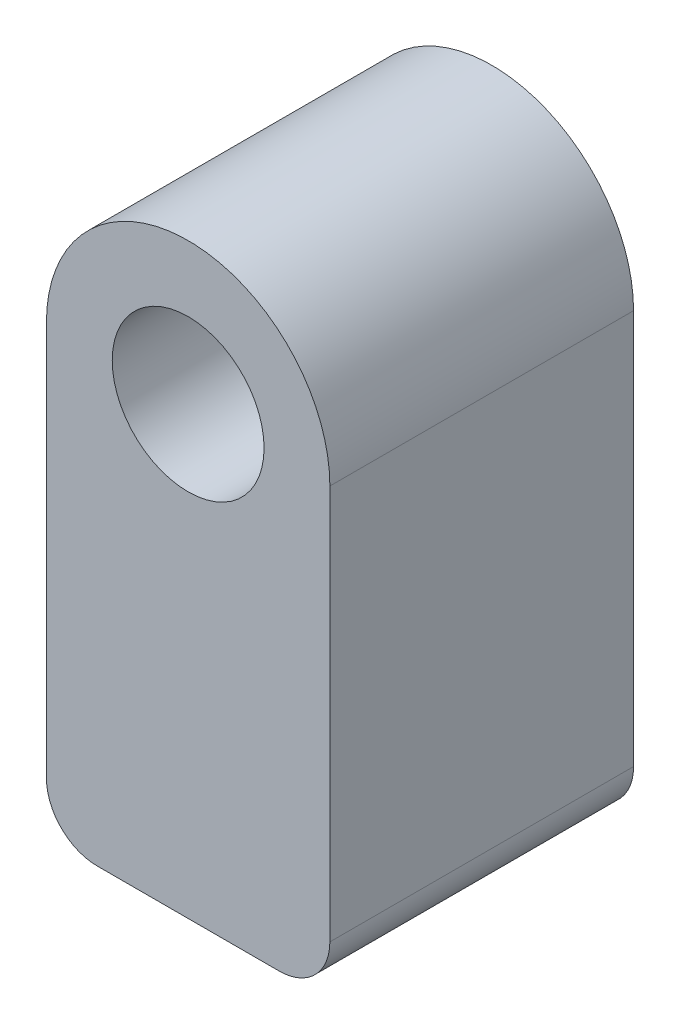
ISO-10303-21;
HEADER;
FILE_DESCRIPTION(('STEP AP214'),'2;1');
FILE_NAME('part.step','',(''),(''),'','','');
FILE_SCHEMA(('AUTOMOTIVE_DESIGN { 1 0 10303 214 1 1 1 1 }'));
ENDSEC;
DATA;
#1=APPLICATION_CONTEXT('core data for automotive mechanical design processes');
#2=APPLICATION_PROTOCOL_DEFINITION('international standard','automotive_design',2000,#1);
#3=PRODUCT_CONTEXT('',#1,'mechanical');
#4=PRODUCT('Part','Part','',(#3));
#5=PRODUCT_RELATED_PRODUCT_CATEGORY('part','',(#4));
#6=PRODUCT_DEFINITION_FORMATION('','',#4);
#7=PRODUCT_DEFINITION_CONTEXT('part definition',#1,'design');
#8=PRODUCT_DEFINITION('design','',#6,#7);
#9=PRODUCT_DEFINITION_SHAPE('','',#8);
#10=(LENGTH_UNIT() NAMED_UNIT(*) SI_UNIT(.MILLI.,.METRE.));
#11=(NAMED_UNIT(*) PLANE_ANGLE_UNIT() SI_UNIT($,.RADIAN.));
#12=(NAMED_UNIT(*) SI_UNIT($,.STERADIAN.) SOLID_ANGLE_UNIT());
#13=UNCERTAINTY_MEASURE_WITH_UNIT(LENGTH_MEASURE(1.E-05),#10,'distance_accuracy_value','');
#14=(GEOMETRIC_REPRESENTATION_CONTEXT(3) GLOBAL_UNCERTAINTY_ASSIGNED_CONTEXT((#13)) GLOBAL_UNIT_ASSIGNED_CONTEXT((#10,
#11,#12)) REPRESENTATION_CONTEXT('',''));
#15=CARTESIAN_POINT('',(0.,0.,0.));
#16=DIRECTION('',(0.,0.,1.));
#17=DIRECTION('',(1.,0.,0.));
#18=AXIS2_PLACEMENT_3D('',#15,#16,#17);
#19=CARTESIAN_POINT('',(0.,-176.53,38.1));
#20=DIRECTION('',(0.,1.,0.));
#21=DIRECTION('',(0.,0.,1.));
#22=AXIS2_PLACEMENT_3D('',#19,#20,#21);
#23=PLANE('',#22);
#24=DIRECTION('',(1.,0.,0.));
#25=VECTOR('',#24,1.);
#26=CARTESIAN_POINT('',(0.,-176.53,0.));
#27=LINE('',#26,#25);
#28=CARTESIAN_POINT('',(-392.43,-176.53,0.));
#29=VERTEX_POINT('',#28);
#30=CARTESIAN_POINT('',(-369.57,-176.53,0.));
#31=VERTEX_POINT('',#30);
#32=EDGE_CURVE('E129',#29,#31,#27,.T.);
#33=ORIENTED_EDGE('',*,*,#32,.T.);
#34=DIRECTION('',(0.,0.,-1.));
#35=VECTOR('',#34,1.);
#36=CARTESIAN_POINT('',(-369.57,-176.53,38.1));
#37=LINE('',#36,#35);
#38=CARTESIAN_POINT('',(-369.57,-176.53,38.1));
#39=VERTEX_POINT('',#38);
#40=EDGE_CURVE('E62',#31,#39,#37,.F.);
#41=ORIENTED_EDGE('',*,*,#40,.T.);
#42=DIRECTION('',(1.,0.,0.));
#43=VECTOR('',#42,1.);
#44=CARTESIAN_POINT('',(0.,-176.53,38.1));
#45=LINE('',#44,#43);
#46=CARTESIAN_POINT('',(-392.43,-176.53,38.1));
#47=VERTEX_POINT('',#46);
#48=EDGE_CURVE('E120',#47,#39,#45,.T.);
#49=ORIENTED_EDGE('',*,*,#48,.F.);
#50=DIRECTION('',(0.,0.,-1.));
#51=VECTOR('',#50,1.);
#52=CARTESIAN_POINT('',(-392.43,-176.53,38.1));
#53=LINE('',#52,#51);
#54=EDGE_CURVE('E144',#47,#29,#53,.T.);
#55=ORIENTED_EDGE('',*,*,#54,.T.);
#56=EDGE_LOOP('',(#33,#41,#49,#55));
#57=FACE_BOUND('',#56,.T.);
#58=ADVANCED_FACE('F41',(#57),#23,.F.);
#59=CARTESIAN_POINT('',(-363.22,1.13401351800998E-12,38.1));
#60=DIRECTION('',(1.,0.,0.));
#61=DIRECTION('',(0.,1.,0.));
#62=AXIS2_PLACEMENT_3D('',#59,#60,#61);
#63=PLANE('',#62);
#64=DIRECTION('',(0.,-1.,0.));
#65=VECTOR('',#64,1.);
#66=CARTESIAN_POINT('',(-363.22,1.13401351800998E-12,38.1));
#67=LINE('',#66,#65);
#68=CARTESIAN_POINT('',(-363.22,-120.65,38.1));
#69=VERTEX_POINT('',#68);
#70=CARTESIAN_POINT('',(-363.22,-170.18,38.1));
#71=VERTEX_POINT('',#70);
#72=EDGE_CURVE('E101',#69,#71,#67,.T.);
#73=ORIENTED_EDGE('',*,*,#72,.T.);
#74=DIRECTION('',(0.,0.,-1.));
#75=VECTOR('',#74,1.);
#76=CARTESIAN_POINT('',(-363.22,-170.18,0.));
#77=LINE('',#76,#75);
#78=CARTESIAN_POINT('',(-363.22,-170.18,0.));
#79=VERTEX_POINT('',#78);
#80=EDGE_CURVE('E107',#71,#79,#77,.T.);
#81=ORIENTED_EDGE('',*,*,#80,.T.);
#82=DIRECTION('',(0.,-1.,0.));
#83=VECTOR('',#82,1.);
#84=CARTESIAN_POINT('',(-363.22,1.13401351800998E-12,0.));
#85=LINE('',#84,#83);
#86=CARTESIAN_POINT('',(-363.22,-120.65,0.));
#87=VERTEX_POINT('',#86);
#88=EDGE_CURVE('E104',#87,#79,#85,.T.);
#89=ORIENTED_EDGE('',*,*,#88,.F.);
#90=DIRECTION('',(0.,0.,-1.));
#91=VECTOR('',#90,1.);
#92=CARTESIAN_POINT('',(-363.22,-120.65,38.1));
#93=LINE('',#92,#91);
#94=EDGE_CURVE('E96',#69,#87,#93,.T.);
#95=ORIENTED_EDGE('',*,*,#94,.F.);
#96=EDGE_LOOP('',(#73,#81,#89,#95));
#97=FACE_BOUND('',#96,.T.);
#98=ADVANCED_FACE('F98',(#97),#63,.T.);
#99=CARTESIAN_POINT('',(-381.,-120.65,38.1));
#100=DIRECTION('',(0.,0.,-1.));
#101=DIRECTION('',(-1.,0.,0.));
#102=AXIS2_PLACEMENT_3D('',#99,#100,#101);
#103=CYLINDRICAL_SURFACE('',#102,17.78);
#104=CARTESIAN_POINT('',(-381.,-120.65,0.));
#105=DIRECTION('',(0.,0.,1.));
#106=DIRECTION('',(1.,0.,0.));
#107=AXIS2_PLACEMENT_3D('',#104,#105,#106);
#108=CIRCLE('',#107,17.78);
#109=CARTESIAN_POINT('',(-398.78,-120.65,0.));
#110=VERTEX_POINT('',#109);
#111=EDGE_CURVE('E132',#87,#110,#108,.T.);
#112=ORIENTED_EDGE('',*,*,#111,.T.);
#113=DIRECTION('',(0.,0.,-1.));
#114=VECTOR('',#113,1.);
#115=CARTESIAN_POINT('',(-398.78,-120.65,38.1));
#116=LINE('',#115,#114);
#117=CARTESIAN_POINT('',(-398.78,-120.65,38.1));
#118=VERTEX_POINT('',#117);
#119=EDGE_CURVE('E108',#118,#110,#116,.T.);
#120=ORIENTED_EDGE('',*,*,#119,.F.);
#121=CARTESIAN_POINT('',(-381.,-120.65,38.1));
#122=DIRECTION('',(0.,0.,1.));
#123=DIRECTION('',(1.,0.,0.));
#124=AXIS2_PLACEMENT_3D('',#121,#122,#123);
#125=CIRCLE('',#124,17.78);
#126=EDGE_CURVE('E111',#69,#118,#125,.T.);
#127=ORIENTED_EDGE('',*,*,#126,.F.);
#128=ORIENTED_EDGE('',*,*,#94,.T.);
#129=EDGE_LOOP('',(#112,#120,#127,#128));
#130=FACE_BOUND('',#129,.T.);
#131=ADVANCED_FACE('F112',(#130),#103,.T.);
#132=CARTESIAN_POINT('',(-398.780000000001,-1.2450358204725E-12,38.1));
#133=DIRECTION('',(1.,0.,0.));
#134=DIRECTION('',(0.,1.,0.));
#135=AXIS2_PLACEMENT_3D('',#132,#133,#134);
#136=PLANE('',#135);
#137=DIRECTION('',(0.,-1.,0.));
#138=VECTOR('',#137,1.);
#139=CARTESIAN_POINT('',(-398.780000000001,-1.2450358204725E-12,0.));
#140=LINE('',#139,#138);
#141=CARTESIAN_POINT('',(-398.78,-170.18,0.));
#142=VERTEX_POINT('',#141);
#143=EDGE_CURVE('E134',#110,#142,#140,.T.);
#144=ORIENTED_EDGE('',*,*,#143,.T.);
#145=DIRECTION('',(0.,0.,-1.));
#146=VECTOR('',#145,1.);
#147=CARTESIAN_POINT('',(-398.78,-170.18,38.1));
#148=LINE('',#147,#146);
#149=CARTESIAN_POINT('',(-398.78,-170.18,38.1));
#150=VERTEX_POINT('',#149);
#151=EDGE_CURVE('E11',#142,#150,#148,.F.);
#152=ORIENTED_EDGE('',*,*,#151,.T.);
#153=DIRECTION('',(0.,-1.,0.));
#154=VECTOR('',#153,1.);
#155=CARTESIAN_POINT('',(-398.780000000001,-1.2450358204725E-12,38.1));
#156=LINE('',#155,#154);
#157=EDGE_CURVE('E115',#118,#150,#156,.T.);
#158=ORIENTED_EDGE('',*,*,#157,.F.);
#159=ORIENTED_EDGE('',*,*,#119,.T.);
#160=EDGE_LOOP('',(#144,#152,#158,#159));
#161=FACE_BOUND('',#160,.T.);
#162=ADVANCED_FACE('F157',(#161),#136,.F.);
#163=CARTESIAN_POINT('',(-381.,-120.65,38.1));
#164=DIRECTION('',(0.,0.,-1.));
#165=DIRECTION('',(-1.,0.,0.));
#166=AXIS2_PLACEMENT_3D('',#163,#164,#165);
#167=CYLINDRICAL_SURFACE('',#166,9.52500000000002);
#168=CARTESIAN_POINT('',(-381.,-120.65,38.1));
#169=DIRECTION('',(0.,0.,1.));
#170=DIRECTION('',(1.,0.,0.));
#171=AXIS2_PLACEMENT_3D('',#168,#169,#170);
#172=CIRCLE('',#171,9.52500000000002);
#173=CARTESIAN_POINT('',(-390.525,-120.65,38.1));
#174=VERTEX_POINT('',#173);
#175=EDGE_CURVE('E126',#174,#174,#172,.T.);
#176=CARTESIAN_POINT('',(-381.,-120.65,0.));
#177=DIRECTION('',(0.,0.,1.));
#178=DIRECTION('',(1.,0.,0.));
#179=AXIS2_PLACEMENT_3D('',#176,#177,#178);
#180=CIRCLE('',#179,9.52500000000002);
#181=CARTESIAN_POINT('',(-390.525,-120.65,0.));
#182=VERTEX_POINT('',#181);
#183=EDGE_CURVE('E122',#182,#182,#180,.T.);
#184=CARTESIAN_POINT('',(-390.525,-120.65,38.1));
#185=CARTESIAN_POINT('',(-390.525,-120.65,37.703125));
#186=CARTESIAN_POINT('',(-390.525,-120.65,37.30625));
#187=CARTESIAN_POINT('',(-390.525,-120.65,36.5125));
#188=CARTESIAN_POINT('',(-390.525,-120.65,36.115625));
#189=CARTESIAN_POINT('',(-390.525,-120.65,35.321875));
#190=CARTESIAN_POINT('',(-390.525,-120.65,34.925));
#191=CARTESIAN_POINT('',(-390.525,-120.65,34.13125));
#192=CARTESIAN_POINT('',(-390.525,-120.65,33.734375));
#193=CARTESIAN_POINT('',(-390.525,-120.65,32.940625));
#194=CARTESIAN_POINT('',(-390.525,-120.65,32.54375));
#195=CARTESIAN_POINT('',(-390.525,-120.65,31.75));
#196=CARTESIAN_POINT('',(-390.525,-120.65,31.353125));
#197=CARTESIAN_POINT('',(-390.525,-120.65,30.559375));
#198=CARTESIAN_POINT('',(-390.525,-120.65,30.1625));
#199=CARTESIAN_POINT('',(-390.525,-120.65,29.36875));
#200=CARTESIAN_POINT('',(-390.525,-120.65,28.971875));
#201=CARTESIAN_POINT('',(-390.525,-120.65,28.178125));
#202=CARTESIAN_POINT('',(-390.525,-120.65,27.78125));
#203=CARTESIAN_POINT('',(-390.525,-120.65,26.9875));
#204=CARTESIAN_POINT('',(-390.525,-120.65,26.590625));
#205=CARTESIAN_POINT('',(-390.525,-120.65,25.796875));
#206=CARTESIAN_POINT('',(-390.525,-120.65,25.4));
#207=CARTESIAN_POINT('',(-390.525,-120.65,24.60625));
#208=CARTESIAN_POINT('',(-390.525,-120.65,24.209375));
#209=CARTESIAN_POINT('',(-390.525,-120.65,23.415625));
#210=CARTESIAN_POINT('',(-390.525,-120.65,23.01875));
#211=CARTESIAN_POINT('',(-390.525,-120.65,22.225));
#212=CARTESIAN_POINT('',(-390.525,-120.65,21.828125));
#213=CARTESIAN_POINT('',(-390.525,-120.65,21.034375));
#214=CARTESIAN_POINT('',(-390.525,-120.65,20.6375));
#215=CARTESIAN_POINT('',(-390.525,-120.65,19.84375));
#216=CARTESIAN_POINT('',(-390.525,-120.65,19.446875));
#217=CARTESIAN_POINT('',(-390.525,-120.65,18.653125));
#218=CARTESIAN_POINT('',(-390.525,-120.65,18.25625));
#219=CARTESIAN_POINT('',(-390.525,-120.65,17.4625));
#220=CARTESIAN_POINT('',(-390.525,-120.65,17.065625));
#221=CARTESIAN_POINT('',(-390.525,-120.65,16.271875));
#222=CARTESIAN_POINT('',(-390.525,-120.65,15.875));
#223=CARTESIAN_POINT('',(-390.525,-120.65,15.08125));
#224=CARTESIAN_POINT('',(-390.525,-120.65,14.684375));
#225=CARTESIAN_POINT('',(-390.525,-120.65,13.890625));
#226=CARTESIAN_POINT('',(-390.525,-120.65,13.49375));
#227=CARTESIAN_POINT('',(-390.525,-120.65,12.7));
#228=CARTESIAN_POINT('',(-390.525,-120.65,12.303125));
#229=CARTESIAN_POINT('',(-390.525,-120.65,11.509375));
#230=CARTESIAN_POINT('',(-390.525,-120.65,11.1125));
#231=CARTESIAN_POINT('',(-390.525,-120.65,10.31875));
#232=CARTESIAN_POINT('',(-390.525,-120.65,9.92187499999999));
#233=CARTESIAN_POINT('',(-390.525,-120.65,9.128125));
#234=CARTESIAN_POINT('',(-390.525,-120.65,8.73124999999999));
#235=CARTESIAN_POINT('',(-390.525,-120.65,7.93749999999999));
#236=CARTESIAN_POINT('',(-390.525,-120.65,7.54062499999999));
#237=CARTESIAN_POINT('',(-390.525,-120.65,6.746875));
#238=CARTESIAN_POINT('',(-390.525,-120.65,6.35));
#239=CARTESIAN_POINT('',(-390.525,-120.65,5.55625));
#240=CARTESIAN_POINT('',(-390.525,-120.65,5.159375));
#241=CARTESIAN_POINT('',(-390.525,-120.65,4.365625));
#242=CARTESIAN_POINT('',(-390.525,-120.65,3.96875));
#243=CARTESIAN_POINT('',(-390.525,-120.65,3.175));
#244=CARTESIAN_POINT('',(-390.525,-120.65,2.778125));
#245=CARTESIAN_POINT('',(-390.525,-120.65,1.984375));
#246=CARTESIAN_POINT('',(-390.525,-120.65,1.5875));
#247=CARTESIAN_POINT('',(-390.525,-120.65,0.79375));
#248=CARTESIAN_POINT('',(-390.525,-120.65,0.396875));
#249=CARTESIAN_POINT('',(-390.525,-120.65,0.));
#250=B_SPLINE_CURVE_WITH_KNOTS('',3,(#184,#185,#186,#187,#188,#189,#190,#191,#192,#193,#194,
#195,#196,#197,#198,#199,#200,#201,#202,#203,#204,#205,#206,#207,#208,#209,#210,#211,#212,#213,
#214,#215,#216,#217,#218,#219,#220,#221,#222,#223,#224,#225,#226,#227,#228,#229,#230,#231,#232,
#233,#234,#235,#236,#237,#238,#239,#240,#241,#242,#243,#244,#245,#246,#247,#248,#249),
.UNSPECIFIED.,.F.,.F.,(4,2,2,2,2,2,2,2,2,2,2,2,2,2,2,2,2,2,2,2,2,2,2,2,2,2,2,2,2,2,2,2,4),(0.,
1.190625,2.38125,3.571875,4.7625,5.953125,7.14375,8.334375,9.52500000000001,10.715625,11.90625,
13.096875,14.2875,15.478125,16.66875,17.859375,19.05,20.240625,21.43125,22.621875,23.8125,
25.003125,26.19375,27.384375,28.575,29.765625,30.95625,32.146875,33.3375,34.528125,35.71875,
36.909375,38.1),.UNSPECIFIED.);
#251=EDGE_CURVE('BSEAM159',#174,#182,#250,.T.);
#252=ORIENTED_EDGE('',*,*,#175,.T.);
#253=ORIENTED_EDGE('',*,*,#183,.F.);
#254=ORIENTED_EDGE('',*,*,#251,.T.);
#255=ORIENTED_EDGE('',*,*,#251,.F.);
#256=EDGE_LOOP('',(#252,#254,#253,#255));
#257=FACE_BOUND('',#256,.T.);
#258=ADVANCED_FACE('F159',(#257),#167,.F.);
#259=CARTESIAN_POINT('',(0.,0.,38.1));
#260=DIRECTION('',(0.,0.,1.));
#261=DIRECTION('',(1.,0.,0.));
#262=AXIS2_PLACEMENT_3D('',#259,#260,#261);
#263=PLANE('',#262);
#264=ORIENTED_EDGE('',*,*,#48,.T.);
#265=CARTESIAN_POINT('',(-369.57,-170.18,38.1));
#266=DIRECTION('',(0.,0.,1.));
#267=DIRECTION('',(1.,0.,0.));
#268=AXIS2_PLACEMENT_3D('',#265,#266,#267);
#269=CIRCLE('',#268,6.35);
#270=EDGE_CURVE('E49',#39,#71,#269,.T.);
#271=ORIENTED_EDGE('',*,*,#270,.T.);
#272=ORIENTED_EDGE('',*,*,#72,.F.);
#273=ORIENTED_EDGE('',*,*,#126,.T.);
#274=ORIENTED_EDGE('',*,*,#157,.T.);
#275=CARTESIAN_POINT('',(-392.43,-170.18,38.1));
#276=DIRECTION('',(0.,0.,1.));
#277=DIRECTION('',(1.,0.,0.));
#278=AXIS2_PLACEMENT_3D('',#275,#276,#277);
#279=CIRCLE('',#278,6.35);
#280=EDGE_CURVE('E148',#150,#47,#279,.T.);
#281=ORIENTED_EDGE('',*,*,#280,.T.);
#282=EDGE_LOOP('',(#264,#271,#272,#273,#274,#281));
#283=FACE_BOUND('',#282,.T.);
#284=ORIENTED_EDGE('',*,*,#175,.F.);
#285=EDGE_LOOP('',(#284));
#286=FACE_BOUND('',#285,.T.);
#287=ADVANCED_FACE('F117',(#283,#286),#263,.T.);
#288=CARTESIAN_POINT('',(0.,0.,0.));
#289=DIRECTION('',(0.,0.,1.));
#290=DIRECTION('',(1.,0.,0.));
#291=AXIS2_PLACEMENT_3D('',#288,#289,#290);
#292=PLANE('',#291);
#293=ORIENTED_EDGE('',*,*,#88,.T.);
#294=CARTESIAN_POINT('',(-369.57,-170.18,0.));
#295=DIRECTION('',(0.,0.,1.));
#296=DIRECTION('',(1.,0.,0.));
#297=AXIS2_PLACEMENT_3D('',#294,#295,#296);
#298=CIRCLE('',#297,6.35);
#299=EDGE_CURVE('E142',#79,#31,#298,.F.);
#300=ORIENTED_EDGE('',*,*,#299,.T.);
#301=ORIENTED_EDGE('',*,*,#32,.F.);
#302=CARTESIAN_POINT('',(-392.43,-170.18,0.));
#303=DIRECTION('',(0.,0.,1.));
#304=DIRECTION('',(1.,0.,0.));
#305=AXIS2_PLACEMENT_3D('',#302,#303,#304);
#306=CIRCLE('',#305,6.35);
#307=EDGE_CURVE('E140',#29,#142,#306,.F.);
#308=ORIENTED_EDGE('',*,*,#307,.T.);
#309=ORIENTED_EDGE('',*,*,#143,.F.);
#310=ORIENTED_EDGE('',*,*,#111,.F.);
#311=EDGE_LOOP('',(#293,#300,#301,#308,#309,#310));
#312=FACE_BOUND('',#311,.T.);
#313=ORIENTED_EDGE('',*,*,#183,.T.);
#314=EDGE_LOOP('',(#313));
#315=FACE_BOUND('',#314,.T.);
#316=ADVANCED_FACE('F155',(#312,#315),#292,.F.);
#317=CARTESIAN_POINT('',(-369.57,-170.18,38.1));
#318=DIRECTION('',(0.,0.,1.));
#319=DIRECTION('',(1.,0.,0.));
#320=AXIS2_PLACEMENT_3D('',#317,#318,#319);
#321=CYLINDRICAL_SURFACE('',#320,6.35);
#322=ORIENTED_EDGE('',*,*,#270,.F.);
#323=ORIENTED_EDGE('',*,*,#40,.F.);
#324=ORIENTED_EDGE('',*,*,#299,.F.);
#325=ORIENTED_EDGE('',*,*,#80,.F.);
#326=EDGE_LOOP('',(#322,#323,#324,#325));
#327=FACE_BOUND('',#326,.T.);
#328=ADVANCED_FACE('F175',(#327),#321,.T.);
#329=CARTESIAN_POINT('',(-392.43,-170.18,38.1));
#330=DIRECTION('',(0.,0.,-1.));
#331=DIRECTION('',(-1.,0.,0.));
#332=AXIS2_PLACEMENT_3D('',#329,#330,#331);
#333=CYLINDRICAL_SURFACE('',#332,6.35);
#334=ORIENTED_EDGE('',*,*,#280,.F.);
#335=ORIENTED_EDGE('',*,*,#151,.F.);
#336=ORIENTED_EDGE('',*,*,#307,.F.);
#337=ORIENTED_EDGE('',*,*,#54,.F.);
#338=EDGE_LOOP('',(#334,#335,#336,#337));
#339=FACE_BOUND('',#338,.T.);
#340=ADVANCED_FACE('F43',(#339),#333,.T.);
#341=CLOSED_SHELL('',(#58,#98,#131,#162,#258,#287,#316,#328,#340));
#342=MANIFOLD_SOLID_BREP('B2',#341);
#343=ADVANCED_BREP_SHAPE_REPRESENTATION('',(#18,#342),#14);
#344=SHAPE_DEFINITION_REPRESENTATION(#9,#343);
ENDSEC;
END-ISO-10303-21;
